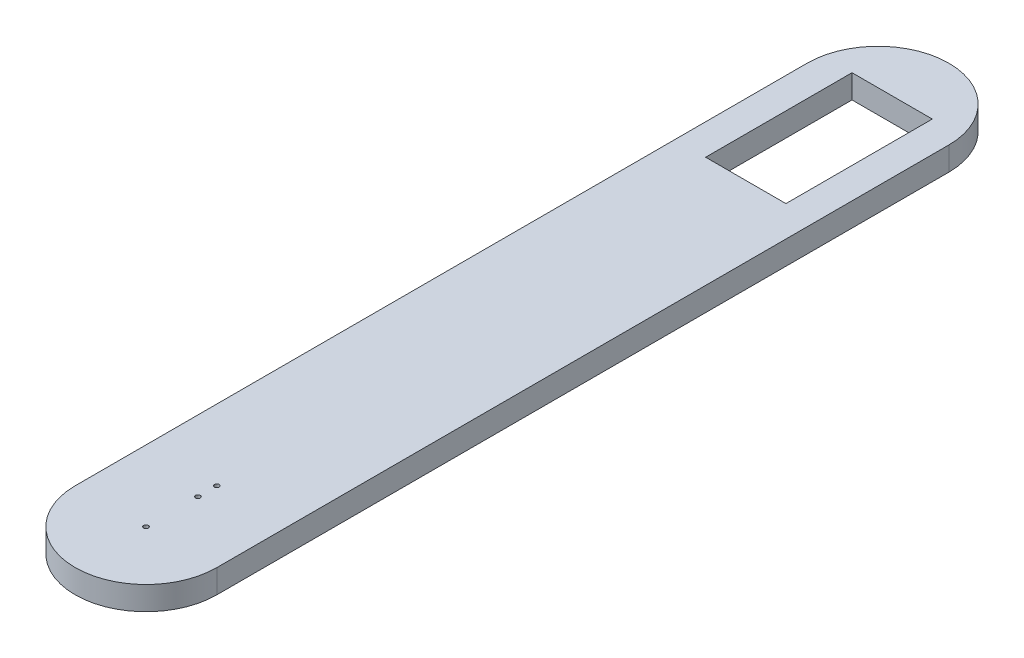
from build123d import *

# Parameters (mm, degrees)
BOSS_EXTRUDE1_DEPTH = 5
SKETCH2_R           = 0.5
CUT_EXTRUDE1_DEPTH  = 10
SKETCH3_W           = 17
SKETCH3_H           = 31
CUT_EXTRUDE2_DEPTH  = 173.699160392


with BuildPart() as part:
    # Sketch1 → Boss-Extrude1 (new body)
    with BuildSketch(Plane(origin=(0, 0, 0), x_dir=(1, 0, 0), z_dir=(0, 1, 0))):
        with BuildLine():
            Line((0, 0), (0, 155))
            ThreePointArc((0, 155), (15, 170), (30, 155))
            Line((30, 155), (30, 0))
            ThreePointArc((30, 0), (15, -15), (0, 0))
        make_face()
    extrude(amount=BOSS_EXTRUDE1_DEPTH)

    # Sketch2 → Cut-Extrude1 (cut)
    with BuildSketch(Plane(origin=(0, 5, 0), x_dir=(1, 0, 0), z_dir=(0, 1, 0))):
        with Locations(Location((15, 11, 0), (0, 0, 270))):
            Circle(SKETCH2_R)
        with Locations(Location((15, 15, 0), (0, 0, 270))):
            Circle(SKETCH2_R)
        with Locations(Location((15, 0, 0), (0, 0, 270))):
            Circle(SKETCH2_R)
    extrude(amount=-CUT_EXTRUDE1_DEPTH, mode=Mode.SUBTRACT)

    # Sketch3 → Cut-Extrude2 (cut, through all)
    with BuildSketch(Plane(origin=(0, 5, 0), x_dir=(1, 0, 0), z_dir=(0, 1, 0))):
        with Locations((15, 142.5)):
            Rectangle(SKETCH3_W, SKETCH3_H)
    extrude(amount=-CUT_EXTRUDE2_DEPTH, mode=Mode.SUBTRACT)


solid = part.part
